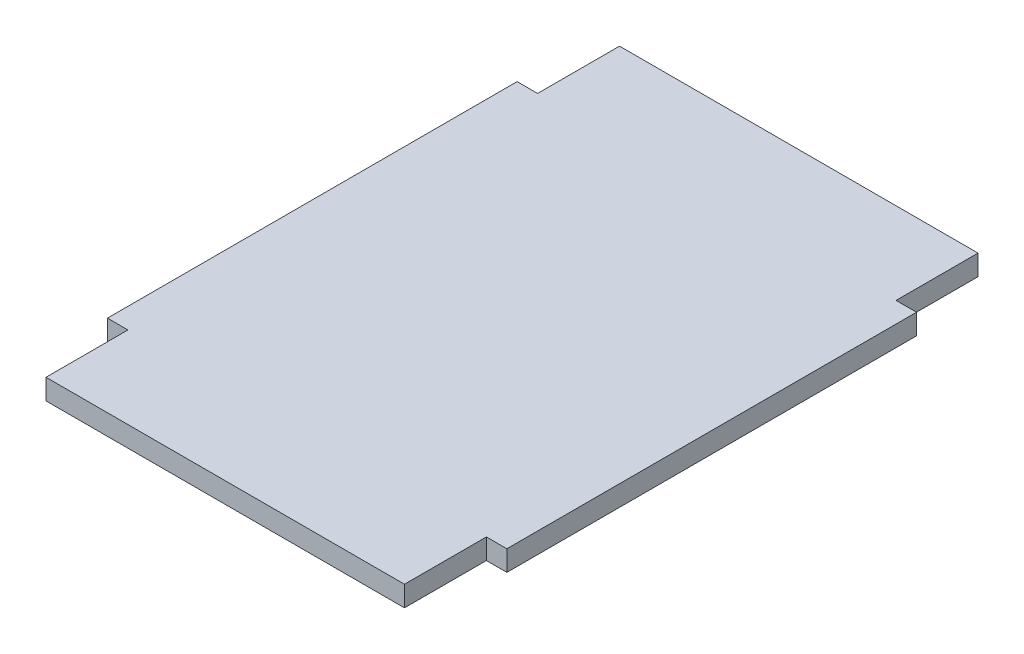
ISO-10303-21;
HEADER;
FILE_DESCRIPTION(('STEP AP214'),'2;1');
FILE_NAME('part.step','',(''),(''),'','','');
FILE_SCHEMA(('AUTOMOTIVE_DESIGN { 1 0 10303 214 1 1 1 1 }'));
ENDSEC;
DATA;
#1=APPLICATION_CONTEXT('core data for automotive mechanical design processes');
#2=APPLICATION_PROTOCOL_DEFINITION('international standard','automotive_design',2000,#1);
#3=PRODUCT_CONTEXT('',#1,'mechanical');
#4=PRODUCT('Part','Part','',(#3));
#5=PRODUCT_RELATED_PRODUCT_CATEGORY('part','',(#4));
#6=PRODUCT_DEFINITION_FORMATION('','',#4);
#7=PRODUCT_DEFINITION_CONTEXT('part definition',#1,'design');
#8=PRODUCT_DEFINITION('design','',#6,#7);
#9=PRODUCT_DEFINITION_SHAPE('','',#8);
#10=(LENGTH_UNIT() NAMED_UNIT(*) SI_UNIT(.MILLI.,.METRE.));
#11=(NAMED_UNIT(*) PLANE_ANGLE_UNIT() SI_UNIT($,.RADIAN.));
#12=(NAMED_UNIT(*) SI_UNIT($,.STERADIAN.) SOLID_ANGLE_UNIT());
#13=UNCERTAINTY_MEASURE_WITH_UNIT(LENGTH_MEASURE(1.E-05),#10,'distance_accuracy_value','');
#14=(GEOMETRIC_REPRESENTATION_CONTEXT(3) GLOBAL_UNCERTAINTY_ASSIGNED_CONTEXT((#13)) GLOBAL_UNIT_ASSIGNED_CONTEXT((#10,
#11,#12)) REPRESENTATION_CONTEXT('',''));
#15=CARTESIAN_POINT('',(0.,0.,0.));
#16=DIRECTION('',(0.,0.,1.));
#17=DIRECTION('',(1.,0.,0.));
#18=AXIS2_PLACEMENT_3D('',#15,#16,#17);
#19=CARTESIAN_POINT('',(0.,2.,-48.));
#20=DIRECTION('',(0.,0.,1.));
#21=DIRECTION('',(1.,0.,0.));
#22=AXIS2_PLACEMENT_3D('',#19,#20,#21);
#23=PLANE('',#22);
#24=DIRECTION('',(-1.,0.,0.));
#25=VECTOR('',#24,1.);
#26=CARTESIAN_POINT('',(0.,0.,-48.));
#27=LINE('',#26,#25);
#28=CARTESIAN_POINT('',(0.,0.,-48.));
#29=VERTEX_POINT('',#28);
#30=CARTESIAN_POINT('',(-2.,0.,-48.));
#31=VERTEX_POINT('',#30);
#32=EDGE_CURVE('E159',#29,#31,#27,.T.);
#33=ORIENTED_EDGE('',*,*,#32,.T.);
#34=DIRECTION('',(0.,-1.,0.));
#35=VECTOR('',#34,1.);
#36=CARTESIAN_POINT('',(-2.,2.,-48.));
#37=LINE('',#36,#35);
#38=CARTESIAN_POINT('',(-2.,2.,-48.));
#39=VERTEX_POINT('',#38);
#40=EDGE_CURVE('E11',#39,#31,#37,.T.);
#41=ORIENTED_EDGE('',*,*,#40,.F.);
#42=DIRECTION('',(-1.,0.,0.));
#43=VECTOR('',#42,1.);
#44=CARTESIAN_POINT('',(0.,2.,-48.));
#45=LINE('',#44,#43);
#46=CARTESIAN_POINT('',(0.,2.,-48.));
#47=VERTEX_POINT('',#46);
#48=EDGE_CURVE('E222',#47,#39,#45,.T.);
#49=ORIENTED_EDGE('',*,*,#48,.F.);
#50=DIRECTION('',(0.,-1.,0.));
#51=VECTOR('',#50,1.);
#52=CARTESIAN_POINT('',(0.,2.,-48.));
#53=LINE('',#52,#51);
#54=EDGE_CURVE('E51',#47,#29,#53,.T.);
#55=ORIENTED_EDGE('',*,*,#54,.T.);
#56=EDGE_LOOP('',(#33,#41,#49,#55));
#57=FACE_BOUND('',#56,.T.);
#58=ADVANCED_FACE('F35',(#57),#23,.F.);
#59=CARTESIAN_POINT('',(-1.99999999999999,2.,0.));
#60=DIRECTION('',(1.,0.,0.));
#61=DIRECTION('',(0.,0.,-1.));
#62=AXIS2_PLACEMENT_3D('',#59,#60,#61);
#63=PLANE('',#62);
#64=DIRECTION('',(0.,0.,1.));
#65=VECTOR('',#64,1.);
#66=CARTESIAN_POINT('',(-1.99999999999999,0.,0.));
#67=LINE('',#66,#65);
#68=CARTESIAN_POINT('',(-2.,0.,-8.));
#69=VERTEX_POINT('',#68);
#70=EDGE_CURVE('E161',#31,#69,#67,.T.);
#71=ORIENTED_EDGE('',*,*,#70,.T.);
#72=DIRECTION('',(0.,-1.,0.));
#73=VECTOR('',#72,1.);
#74=CARTESIAN_POINT('',(-2.,2.,-8.));
#75=LINE('',#74,#73);
#76=CARTESIAN_POINT('',(-2.,2.,-8.));
#77=VERTEX_POINT('',#76);
#78=EDGE_CURVE('E43',#77,#69,#75,.T.);
#79=ORIENTED_EDGE('',*,*,#78,.F.);
#80=DIRECTION('',(0.,0.,1.));
#81=VECTOR('',#80,1.);
#82=CARTESIAN_POINT('',(-1.99999999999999,2.,0.));
#83=LINE('',#82,#81);
#84=EDGE_CURVE('E101',#39,#77,#83,.T.);
#85=ORIENTED_EDGE('',*,*,#84,.F.);
#86=ORIENTED_EDGE('',*,*,#40,.T.);
#87=EDGE_LOOP('',(#71,#79,#85,#86));
#88=FACE_BOUND('',#87,.T.);
#89=ADVANCED_FACE('F208',(#88),#63,.F.);
#90=CARTESIAN_POINT('',(0.,2.,-8.));
#91=DIRECTION('',(0.,0.,1.));
#92=DIRECTION('',(1.,0.,0.));
#93=AXIS2_PLACEMENT_3D('',#90,#91,#92);
#94=PLANE('',#93);
#95=DIRECTION('',(-1.,0.,0.));
#96=VECTOR('',#95,1.);
#97=CARTESIAN_POINT('',(0.,0.,-8.));
#98=LINE('',#97,#96);
#99=CARTESIAN_POINT('',(0.,0.,-8.));
#100=VERTEX_POINT('',#99);
#101=EDGE_CURVE('E164',#100,#69,#98,.T.);
#102=ORIENTED_EDGE('',*,*,#101,.F.);
#103=DIRECTION('',(0.,-1.,0.));
#104=VECTOR('',#103,1.);
#105=CARTESIAN_POINT('',(0.,2.,-8.));
#106=LINE('',#105,#104);
#107=CARTESIAN_POINT('',(0.,2.,-8.));
#108=VERTEX_POINT('',#107);
#109=EDGE_CURVE('E201',#108,#100,#106,.T.);
#110=ORIENTED_EDGE('',*,*,#109,.F.);
#111=DIRECTION('',(-1.,0.,0.));
#112=VECTOR('',#111,1.);
#113=CARTESIAN_POINT('',(0.,2.,-8.));
#114=LINE('',#113,#112);
#115=EDGE_CURVE('E207',#108,#77,#114,.T.);
#116=ORIENTED_EDGE('',*,*,#115,.T.);
#117=ORIENTED_EDGE('',*,*,#78,.T.);
#118=EDGE_LOOP('',(#102,#110,#116,#117));
#119=FACE_BOUND('',#118,.T.);
#120=ADVANCED_FACE('F205',(#119),#94,.T.);
#121=CARTESIAN_POINT('',(0.,2.,0.));
#122=DIRECTION('',(-1.,0.,0.));
#123=DIRECTION('',(0.,0.,1.));
#124=AXIS2_PLACEMENT_3D('',#121,#122,#123);
#125=PLANE('',#124);
#126=DIRECTION('',(0.,0.,-1.));
#127=VECTOR('',#126,1.);
#128=CARTESIAN_POINT('',(0.,0.,0.));
#129=LINE('',#128,#127);
#130=CARTESIAN_POINT('',(0.,0.,0.));
#131=VERTEX_POINT('',#130);
#132=EDGE_CURVE('E167',#131,#100,#129,.T.);
#133=ORIENTED_EDGE('',*,*,#132,.F.);
#134=DIRECTION('',(0.,-1.,0.));
#135=VECTOR('',#134,1.);
#136=CARTESIAN_POINT('',(0.,2.,0.));
#137=LINE('',#136,#135);
#138=CARTESIAN_POINT('',(0.,2.,0.));
#139=VERTEX_POINT('',#138);
#140=EDGE_CURVE('E199',#139,#131,#137,.T.);
#141=ORIENTED_EDGE('',*,*,#140,.F.);
#142=DIRECTION('',(0.,0.,-1.));
#143=VECTOR('',#142,1.);
#144=CARTESIAN_POINT('',(0.,2.,0.));
#145=LINE('',#144,#143);
#146=EDGE_CURVE('E155',#139,#108,#145,.T.);
#147=ORIENTED_EDGE('',*,*,#146,.T.);
#148=ORIENTED_EDGE('',*,*,#109,.T.);
#149=EDGE_LOOP('',(#133,#141,#147,#148));
#150=FACE_BOUND('',#149,.T.);
#151=ADVANCED_FACE('F216',(#150),#125,.T.);
#152=CARTESIAN_POINT('',(0.,2.,0.));
#153=DIRECTION('',(0.,0.,-1.));
#154=DIRECTION('',(-1.,0.,0.));
#155=AXIS2_PLACEMENT_3D('',#152,#153,#154);
#156=PLANE('',#155);
#157=DIRECTION('',(1.,0.,0.));
#158=VECTOR('',#157,1.);
#159=CARTESIAN_POINT('',(0.,0.,0.));
#160=LINE('',#159,#158);
#161=CARTESIAN_POINT('',(35.,0.,0.));
#162=VERTEX_POINT('',#161);
#163=EDGE_CURVE('E170',#131,#162,#160,.T.);
#164=ORIENTED_EDGE('',*,*,#163,.T.);
#165=DIRECTION('',(0.,-1.,0.));
#166=VECTOR('',#165,1.);
#167=CARTESIAN_POINT('',(35.,2.,0.));
#168=LINE('',#167,#166);
#169=CARTESIAN_POINT('',(35.,2.,0.));
#170=VERTEX_POINT('',#169);
#171=EDGE_CURVE('E196',#170,#162,#168,.T.);
#172=ORIENTED_EDGE('',*,*,#171,.F.);
#173=DIRECTION('',(1.,0.,0.));
#174=VECTOR('',#173,1.);
#175=CARTESIAN_POINT('',(0.,2.,0.));
#176=LINE('',#175,#174);
#177=EDGE_CURVE('E221',#139,#170,#176,.T.);
#178=ORIENTED_EDGE('',*,*,#177,.F.);
#179=ORIENTED_EDGE('',*,*,#140,.T.);
#180=EDGE_LOOP('',(#164,#172,#178,#179));
#181=FACE_BOUND('',#180,.T.);
#182=ADVANCED_FACE('F245',(#181),#156,.F.);
#183=CARTESIAN_POINT('',(35.,2.,0.));
#184=DIRECTION('',(-1.,0.,0.));
#185=DIRECTION('',(0.,0.,1.));
#186=AXIS2_PLACEMENT_3D('',#183,#184,#185);
#187=PLANE('',#186);
#188=DIRECTION('',(0.,0.,-1.));
#189=VECTOR('',#188,1.);
#190=CARTESIAN_POINT('',(35.,0.,0.));
#191=LINE('',#190,#189);
#192=CARTESIAN_POINT('',(35.,0.,-7.99999999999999));
#193=VERTEX_POINT('',#192);
#194=EDGE_CURVE('E173',#162,#193,#191,.T.);
#195=ORIENTED_EDGE('',*,*,#194,.T.);
#196=DIRECTION('',(0.,-1.,0.));
#197=VECTOR('',#196,1.);
#198=CARTESIAN_POINT('',(35.,2.,-7.99999999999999));
#199=LINE('',#198,#197);
#200=CARTESIAN_POINT('',(35.,2.,-7.99999999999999));
#201=VERTEX_POINT('',#200);
#202=EDGE_CURVE('E193',#201,#193,#199,.T.);
#203=ORIENTED_EDGE('',*,*,#202,.F.);
#204=DIRECTION('',(0.,0.,-1.));
#205=VECTOR('',#204,1.);
#206=CARTESIAN_POINT('',(35.,2.,0.));
#207=LINE('',#206,#205);
#208=EDGE_CURVE('E141',#170,#201,#207,.T.);
#209=ORIENTED_EDGE('',*,*,#208,.F.);
#210=ORIENTED_EDGE('',*,*,#171,.T.);
#211=EDGE_LOOP('',(#195,#203,#209,#210));
#212=FACE_BOUND('',#211,.T.);
#213=ADVANCED_FACE('F248',(#212),#187,.F.);
#214=CARTESIAN_POINT('',(0.,2.,-7.99999999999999));
#215=DIRECTION('',(0.,0.,-1.));
#216=DIRECTION('',(-1.,0.,0.));
#217=AXIS2_PLACEMENT_3D('',#214,#215,#216);
#218=PLANE('',#217);
#219=DIRECTION('',(1.,0.,0.));
#220=VECTOR('',#219,1.);
#221=CARTESIAN_POINT('',(0.,0.,-7.99999999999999));
#222=LINE('',#221,#220);
#223=CARTESIAN_POINT('',(37.,0.,-7.99999999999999));
#224=VERTEX_POINT('',#223);
#225=EDGE_CURVE('E175',#193,#224,#222,.T.);
#226=ORIENTED_EDGE('',*,*,#225,.T.);
#227=DIRECTION('',(0.,-1.,0.));
#228=VECTOR('',#227,1.);
#229=CARTESIAN_POINT('',(37.,2.,-7.99999999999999));
#230=LINE('',#229,#228);
#231=CARTESIAN_POINT('',(37.,2.,-7.99999999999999));
#232=VERTEX_POINT('',#231);
#233=EDGE_CURVE('E191',#232,#224,#230,.T.);
#234=ORIENTED_EDGE('',*,*,#233,.F.);
#235=DIRECTION('',(1.,0.,0.));
#236=VECTOR('',#235,1.);
#237=CARTESIAN_POINT('',(0.,2.,-7.99999999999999));
#238=LINE('',#237,#236);
#239=EDGE_CURVE('E227',#201,#232,#238,.T.);
#240=ORIENTED_EDGE('',*,*,#239,.F.);
#241=ORIENTED_EDGE('',*,*,#202,.T.);
#242=EDGE_LOOP('',(#226,#234,#240,#241));
#243=FACE_BOUND('',#242,.T.);
#244=ADVANCED_FACE('F250',(#243),#218,.F.);
#245=CARTESIAN_POINT('',(37.,2.,0.));
#246=DIRECTION('',(1.,0.,0.));
#247=DIRECTION('',(0.,0.,-1.));
#248=AXIS2_PLACEMENT_3D('',#245,#246,#247);
#249=PLANE('',#248);
#250=DIRECTION('',(0.,0.,1.));
#251=VECTOR('',#250,1.);
#252=CARTESIAN_POINT('',(37.,0.,0.));
#253=LINE('',#252,#251);
#254=CARTESIAN_POINT('',(37.,0.,-48.));
#255=VERTEX_POINT('',#254);
#256=EDGE_CURVE('E178',#255,#224,#253,.T.);
#257=ORIENTED_EDGE('',*,*,#256,.F.);
#258=DIRECTION('',(0.,-1.,0.));
#259=VECTOR('',#258,1.);
#260=CARTESIAN_POINT('',(37.,2.,-48.));
#261=LINE('',#260,#259);
#262=CARTESIAN_POINT('',(37.,2.,-48.));
#263=VERTEX_POINT('',#262);
#264=EDGE_CURVE('E189',#263,#255,#261,.T.);
#265=ORIENTED_EDGE('',*,*,#264,.F.);
#266=DIRECTION('',(0.,0.,1.));
#267=VECTOR('',#266,1.);
#268=CARTESIAN_POINT('',(37.,2.,0.));
#269=LINE('',#268,#267);
#270=EDGE_CURVE('E228',#263,#232,#269,.T.);
#271=ORIENTED_EDGE('',*,*,#270,.T.);
#272=ORIENTED_EDGE('',*,*,#233,.T.);
#273=EDGE_LOOP('',(#257,#265,#271,#272));
#274=FACE_BOUND('',#273,.T.);
#275=ADVANCED_FACE('F253',(#274),#249,.T.);
#276=CARTESIAN_POINT('',(1.66533453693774E-13,2.,-48.0000000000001));
#277=DIRECTION('',(0.,0.,-1.));
#278=DIRECTION('',(-1.,0.,0.));
#279=AXIS2_PLACEMENT_3D('',#276,#277,#278);
#280=PLANE('',#279);
#281=DIRECTION('',(1.,0.,0.));
#282=VECTOR('',#281,1.);
#283=CARTESIAN_POINT('',(1.66533453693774E-13,0.,-48.0000000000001));
#284=LINE('',#283,#282);
#285=CARTESIAN_POINT('',(35.,0.,-48.));
#286=VERTEX_POINT('',#285);
#287=EDGE_CURVE('E181',#286,#255,#284,.T.);
#288=ORIENTED_EDGE('',*,*,#287,.F.);
#289=DIRECTION('',(0.,-1.,0.));
#290=VECTOR('',#289,1.);
#291=CARTESIAN_POINT('',(35.,2.,-48.));
#292=LINE('',#291,#290);
#293=CARTESIAN_POINT('',(35.,2.,-48.));
#294=VERTEX_POINT('',#293);
#295=EDGE_CURVE('E149',#294,#286,#292,.T.);
#296=ORIENTED_EDGE('',*,*,#295,.F.);
#297=DIRECTION('',(1.,0.,0.));
#298=VECTOR('',#297,1.);
#299=CARTESIAN_POINT('',(1.66533453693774E-13,2.,-48.0000000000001));
#300=LINE('',#299,#298);
#301=EDGE_CURVE('E138',#294,#263,#300,.T.);
#302=ORIENTED_EDGE('',*,*,#301,.T.);
#303=ORIENTED_EDGE('',*,*,#264,.T.);
#304=EDGE_LOOP('',(#288,#296,#302,#303));
#305=FACE_BOUND('',#304,.T.);
#306=ADVANCED_FACE('F233',(#305),#280,.T.);
#307=CARTESIAN_POINT('',(35.,0.,-56.));
#308=VERTEX_POINT('',#307);
#309=EDGE_CURVE('E146',#286,#308,#191,.T.);
#310=ORIENTED_EDGE('',*,*,#309,.T.);
#311=DIRECTION('',(0.,-1.,0.));
#312=VECTOR('',#311,1.);
#313=CARTESIAN_POINT('',(35.,2.,-56.));
#314=LINE('',#313,#312);
#315=CARTESIAN_POINT('',(35.,2.,-56.));
#316=VERTEX_POINT('',#315);
#317=EDGE_CURVE('E143',#316,#308,#314,.T.);
#318=ORIENTED_EDGE('',*,*,#317,.F.);
#319=EDGE_CURVE('E130',#294,#316,#207,.T.);
#320=ORIENTED_EDGE('',*,*,#319,.F.);
#321=ORIENTED_EDGE('',*,*,#295,.T.);
#322=EDGE_LOOP('',(#310,#318,#320,#321));
#323=FACE_BOUND('',#322,.T.);
#324=ADVANCED_FACE('F144',(#323),#187,.F.);
#325=CARTESIAN_POINT('',(0.,2.,-56.));
#326=DIRECTION('',(0.,0.,-1.));
#327=DIRECTION('',(-1.,0.,0.));
#328=AXIS2_PLACEMENT_3D('',#325,#326,#327);
#329=PLANE('',#328);
#330=DIRECTION('',(1.,0.,0.));
#331=VECTOR('',#330,1.);
#332=CARTESIAN_POINT('',(0.,0.,-56.));
#333=LINE('',#332,#331);
#334=CARTESIAN_POINT('',(0.,0.,-56.));
#335=VERTEX_POINT('',#334);
#336=EDGE_CURVE('E184',#335,#308,#333,.T.);
#337=ORIENTED_EDGE('',*,*,#336,.F.);
#338=DIRECTION('',(0.,-1.,0.));
#339=VECTOR('',#338,1.);
#340=CARTESIAN_POINT('',(0.,2.,-56.));
#341=LINE('',#340,#339);
#342=CARTESIAN_POINT('',(0.,2.,-56.));
#343=VERTEX_POINT('',#342);
#344=EDGE_CURVE('E89',#343,#335,#341,.T.);
#345=ORIENTED_EDGE('',*,*,#344,.F.);
#346=DIRECTION('',(1.,0.,0.));
#347=VECTOR('',#346,1.);
#348=CARTESIAN_POINT('',(0.,2.,-56.));
#349=LINE('',#348,#347);
#350=EDGE_CURVE('E135',#343,#316,#349,.T.);
#351=ORIENTED_EDGE('',*,*,#350,.T.);
#352=ORIENTED_EDGE('',*,*,#317,.T.);
#353=EDGE_LOOP('',(#337,#345,#351,#352));
#354=FACE_BOUND('',#353,.T.);
#355=ADVANCED_FACE('F151',(#354),#329,.T.);
#356=EDGE_CURVE('E171',#29,#335,#129,.T.);
#357=ORIENTED_EDGE('',*,*,#356,.F.);
#358=ORIENTED_EDGE('',*,*,#54,.F.);
#359=EDGE_CURVE('E152',#47,#343,#145,.T.);
#360=ORIENTED_EDGE('',*,*,#359,.T.);
#361=ORIENTED_EDGE('',*,*,#344,.T.);
#362=EDGE_LOOP('',(#357,#358,#360,#361));
#363=FACE_BOUND('',#362,.T.);
#364=ADVANCED_FACE('F263',(#363),#125,.T.);
#365=CARTESIAN_POINT('',(0.,2.,0.));
#366=DIRECTION('',(0.,1.,0.));
#367=DIRECTION('',(0.,0.,1.));
#368=AXIS2_PLACEMENT_3D('',#365,#366,#367);
#369=PLANE('',#368);
#370=ORIENTED_EDGE('',*,*,#48,.T.);
#371=ORIENTED_EDGE('',*,*,#84,.T.);
#372=ORIENTED_EDGE('',*,*,#115,.F.);
#373=ORIENTED_EDGE('',*,*,#146,.F.);
#374=ORIENTED_EDGE('',*,*,#177,.T.);
#375=ORIENTED_EDGE('',*,*,#208,.T.);
#376=ORIENTED_EDGE('',*,*,#239,.T.);
#377=ORIENTED_EDGE('',*,*,#270,.F.);
#378=ORIENTED_EDGE('',*,*,#301,.F.);
#379=ORIENTED_EDGE('',*,*,#319,.T.);
#380=ORIENTED_EDGE('',*,*,#350,.F.);
#381=ORIENTED_EDGE('',*,*,#359,.F.);
#382=EDGE_LOOP('',(#370,#371,#372,#373,#374,#375,#376,#377,#378,#379,#380,#381));
#383=FACE_BOUND('',#382,.T.);
#384=ADVANCED_FACE('F132',(#383),#369,.T.);
#385=CARTESIAN_POINT('',(0.,0.,0.));
#386=DIRECTION('',(0.,1.,0.));
#387=DIRECTION('',(0.,0.,1.));
#388=AXIS2_PLACEMENT_3D('',#385,#386,#387);
#389=PLANE('',#388);
#390=ORIENTED_EDGE('',*,*,#32,.F.);
#391=ORIENTED_EDGE('',*,*,#356,.T.);
#392=ORIENTED_EDGE('',*,*,#336,.T.);
#393=ORIENTED_EDGE('',*,*,#309,.F.);
#394=ORIENTED_EDGE('',*,*,#287,.T.);
#395=ORIENTED_EDGE('',*,*,#256,.T.);
#396=ORIENTED_EDGE('',*,*,#225,.F.);
#397=ORIENTED_EDGE('',*,*,#194,.F.);
#398=ORIENTED_EDGE('',*,*,#163,.F.);
#399=ORIENTED_EDGE('',*,*,#132,.T.);
#400=ORIENTED_EDGE('',*,*,#101,.T.);
#401=ORIENTED_EDGE('',*,*,#70,.F.);
#402=EDGE_LOOP('',(#390,#391,#392,#393,#394,#395,#396,#397,#398,#399,#400,#401));
#403=FACE_BOUND('',#402,.T.);
#404=ADVANCED_FACE('F211',(#403),#389,.F.);
#405=CLOSED_SHELL('',(#58,#89,#120,#151,#182,#213,#244,#275,#306,#324,#355,#364,#384,#404));
#406=MANIFOLD_SOLID_BREP('B2',#405);
#407=ADVANCED_BREP_SHAPE_REPRESENTATION('',(#18,#406),#14);
#408=SHAPE_DEFINITION_REPRESENTATION(#9,#407);
ENDSEC;
END-ISO-10303-21;
